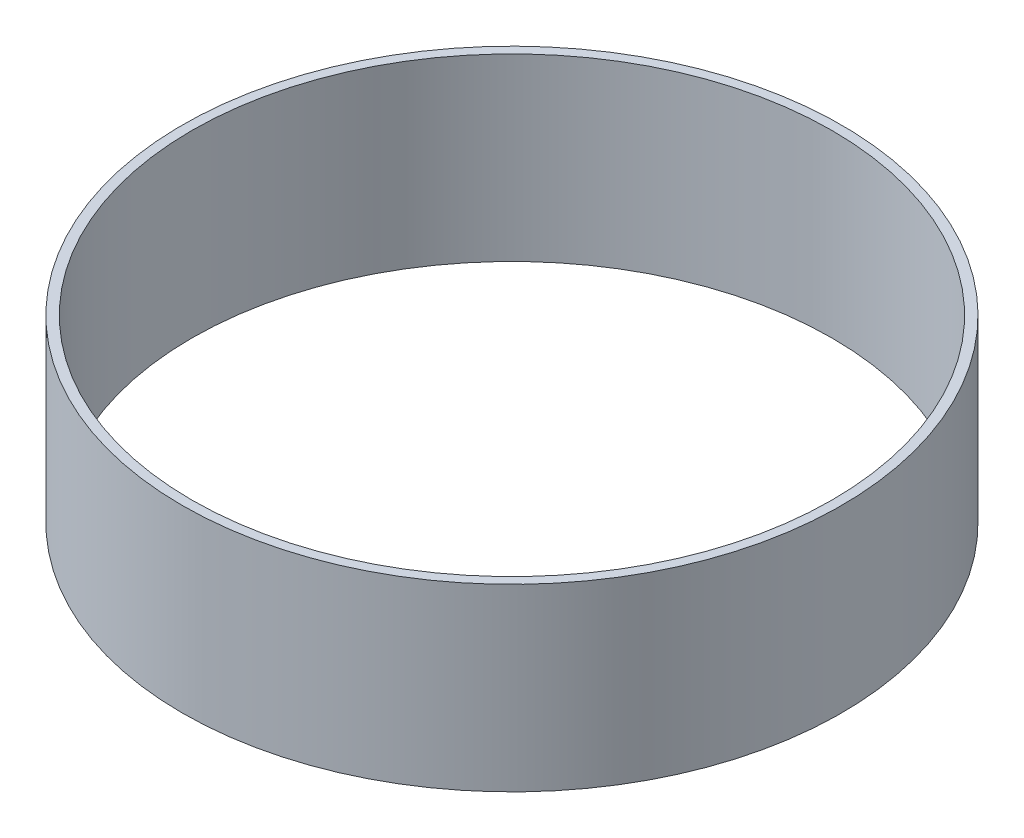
from build123d import *

# Parameters (mm, degrees)
SKETCH2_R           = 33
SKETCH2_R_2         = 32.05
BOSS_EXTRUDE1_DEPTH = 18


with BuildPart() as part:
    # Sketch2 → Boss-Extrude1 (new body)
    with BuildSketch(Plane(origin=(0, 0, 0), x_dir=(1, 0, 0), z_dir=(0, 1, 0))):
        with Locations(Location((0, 0, 0), (0, 0, 270))):
            Circle(SKETCH2_R)
        with Locations(Location((0, 0, 0), (0, 0, 270))):
            Circle(SKETCH2_R_2, mode=Mode.SUBTRACT)
    extrude(amount=BOSS_EXTRUDE1_DEPTH)


solid = part.part
